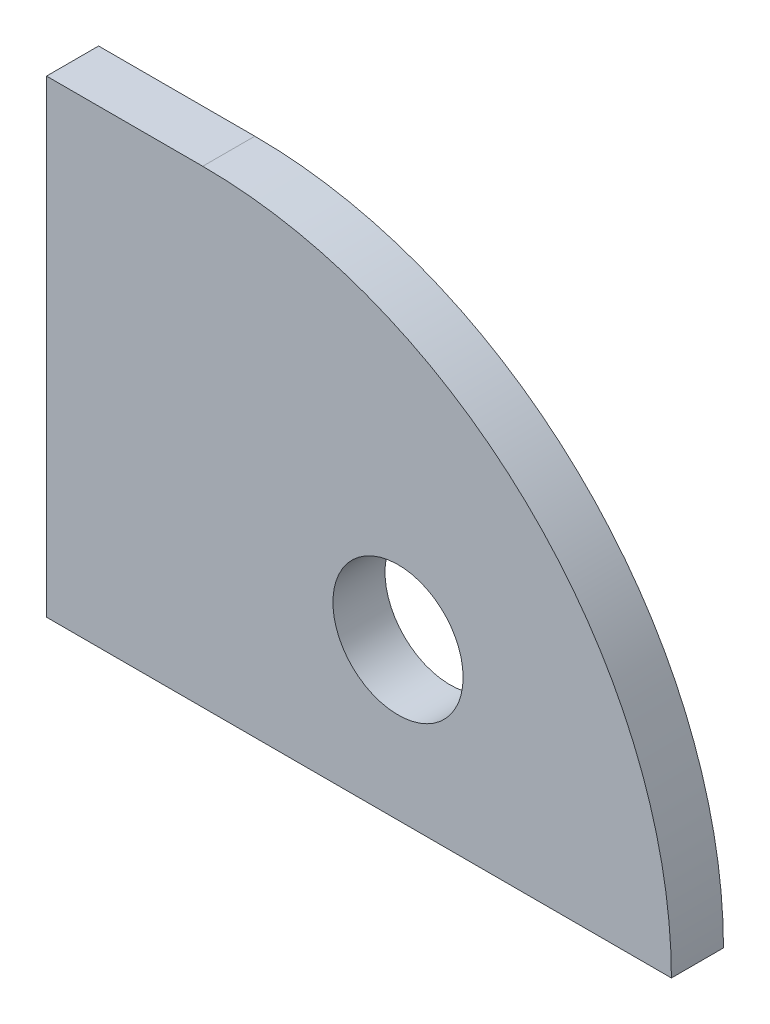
ISO-10303-21;
HEADER;
FILE_DESCRIPTION(('STEP AP214'),'2;1');
FILE_NAME('part.step','',(''),(''),'','','');
FILE_SCHEMA(('AUTOMOTIVE_DESIGN { 1 0 10303 214 1 1 1 1 }'));
ENDSEC;
DATA;
#1=APPLICATION_CONTEXT('core data for automotive mechanical design processes');
#2=APPLICATION_PROTOCOL_DEFINITION('international standard','automotive_design',2000,#1);
#3=PRODUCT_CONTEXT('',#1,'mechanical');
#4=PRODUCT('Part','Part','',(#3));
#5=PRODUCT_RELATED_PRODUCT_CATEGORY('part','',(#4));
#6=PRODUCT_DEFINITION_FORMATION('','',#4);
#7=PRODUCT_DEFINITION_CONTEXT('part definition',#1,'design');
#8=PRODUCT_DEFINITION('design','',#6,#7);
#9=PRODUCT_DEFINITION_SHAPE('','',#8);
#10=(LENGTH_UNIT() NAMED_UNIT(*) SI_UNIT(.MILLI.,.METRE.));
#11=(NAMED_UNIT(*) PLANE_ANGLE_UNIT() SI_UNIT($,.RADIAN.));
#12=(NAMED_UNIT(*) SI_UNIT($,.STERADIAN.) SOLID_ANGLE_UNIT());
#13=UNCERTAINTY_MEASURE_WITH_UNIT(LENGTH_MEASURE(1.E-05),#10,'distance_accuracy_value','');
#14=(GEOMETRIC_REPRESENTATION_CONTEXT(3) GLOBAL_UNCERTAINTY_ASSIGNED_CONTEXT((#13)) GLOBAL_UNIT_ASSIGNED_CONTEXT((#10,
#11,#12)) REPRESENTATION_CONTEXT('',''));
#15=CARTESIAN_POINT('',(0.,0.,0.));
#16=DIRECTION('',(0.,0.,1.));
#17=DIRECTION('',(1.,0.,0.));
#18=AXIS2_PLACEMENT_3D('',#15,#16,#17);
#19=CARTESIAN_POINT('',(27.,16.8234812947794,2.));
#20=DIRECTION('',(0.,-1.,0.));
#21=DIRECTION('',(0.,0.,-1.));
#22=AXIS2_PLACEMENT_3D('',#19,#20,#21);
#23=PLANE('',#22);
#24=DIRECTION('',(-1.,0.,0.));
#25=VECTOR('',#24,1.);
#26=CARTESIAN_POINT('',(27.,16.8234812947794,0.));
#27=LINE('',#26,#25);
#28=CARTESIAN_POINT('',(33.,16.8234812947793,0.));
#29=VERTEX_POINT('',#28);
#30=CARTESIAN_POINT('',(27.,16.8234812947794,0.));
#31=VERTEX_POINT('',#30);
#32=EDGE_CURVE('E392',#29,#31,#27,.T.);
#33=ORIENTED_EDGE('',*,*,#32,.T.);
#34=DIRECTION('',(0.,0.,-1.));
#35=VECTOR('',#34,1.);
#36=CARTESIAN_POINT('',(27.,16.8234812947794,2.));
#37=LINE('',#36,#35);
#38=CARTESIAN_POINT('',(27.,16.8234812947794,2.));
#39=VERTEX_POINT('',#38);
#40=EDGE_CURVE('E11',#39,#31,#37,.T.);
#41=ORIENTED_EDGE('',*,*,#40,.F.);
#42=DIRECTION('',(-1.,0.,0.));
#43=VECTOR('',#42,1.);
#44=CARTESIAN_POINT('',(27.,16.8234812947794,2.));
#45=LINE('',#44,#43);
#46=CARTESIAN_POINT('',(33.,16.8234812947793,2.));
#47=VERTEX_POINT('',#46);
#48=EDGE_CURVE('E415',#47,#39,#45,.T.);
#49=ORIENTED_EDGE('',*,*,#48,.F.);
#50=DIRECTION('',(0.,0.,-1.));
#51=VECTOR('',#50,1.);
#52=CARTESIAN_POINT('',(33.,16.8234812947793,2.));
#53=LINE('',#52,#51);
#54=EDGE_CURVE('E404',#47,#29,#53,.T.);
#55=ORIENTED_EDGE('',*,*,#54,.T.);
#56=EDGE_LOOP('',(#33,#41,#49,#55));
#57=FACE_BOUND('',#56,.T.);
#58=ADVANCED_FACE('F348',(#57),#23,.F.);
#59=CARTESIAN_POINT('',(27.,16.8234812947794,2.));
#60=DIRECTION('',(1.,0.,0.));
#61=DIRECTION('',(0.,0.,-1.));
#62=AXIS2_PLACEMENT_3D('',#59,#60,#61);
#63=PLANE('',#62);
#64=DIRECTION('',(0.,-1.,0.));
#65=VECTOR('',#64,1.);
#66=CARTESIAN_POINT('',(27.,16.8234812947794,0.));
#67=LINE('',#66,#65);
#68=CARTESIAN_POINT('',(27.,-1.17651870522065,0.));
#69=VERTEX_POINT('',#68);
#70=EDGE_CURVE('E388',#31,#69,#67,.T.);
#71=ORIENTED_EDGE('',*,*,#70,.T.);
#72=DIRECTION('',(0.,0.,-1.));
#73=VECTOR('',#72,1.);
#74=CARTESIAN_POINT('',(27.,-1.17651870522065,2.));
#75=LINE('',#74,#73);
#76=CARTESIAN_POINT('',(27.,-1.17651870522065,2.));
#77=VERTEX_POINT('',#76);
#78=EDGE_CURVE('E355',#77,#69,#75,.T.);
#79=ORIENTED_EDGE('',*,*,#78,.F.);
#80=DIRECTION('',(0.,-1.,0.));
#81=VECTOR('',#80,1.);
#82=CARTESIAN_POINT('',(27.,16.8234812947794,2.));
#83=LINE('',#82,#81);
#84=EDGE_CURVE('E400',#39,#77,#83,.T.);
#85=ORIENTED_EDGE('',*,*,#84,.F.);
#86=ORIENTED_EDGE('',*,*,#40,.T.);
#87=EDGE_LOOP('',(#71,#79,#85,#86));
#88=FACE_BOUND('',#87,.T.);
#89=ADVANCED_FACE('F399',(#88),#63,.F.);
#90=CARTESIAN_POINT('',(27.,-1.17651870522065,2.));
#91=DIRECTION('',(0.,1.,0.));
#92=DIRECTION('',(0.,0.,1.));
#93=AXIS2_PLACEMENT_3D('',#90,#91,#92);
#94=PLANE('',#93);
#95=DIRECTION('',(1.,0.,0.));
#96=VECTOR('',#95,1.);
#97=CARTESIAN_POINT('',(27.,-1.17651870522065,0.));
#98=LINE('',#97,#96);
#99=CARTESIAN_POINT('',(51.,-1.17651870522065,0.));
#100=VERTEX_POINT('',#99);
#101=EDGE_CURVE('E393',#69,#100,#98,.T.);
#102=ORIENTED_EDGE('',*,*,#101,.T.);
#103=DIRECTION('',(0.,0.,-1.));
#104=VECTOR('',#103,1.);
#105=CARTESIAN_POINT('',(51.,-1.17651870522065,2.));
#106=LINE('',#105,#104);
#107=CARTESIAN_POINT('',(51.,-1.17651870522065,2.));
#108=VERTEX_POINT('',#107);
#109=EDGE_CURVE('E421',#108,#100,#106,.T.);
#110=ORIENTED_EDGE('',*,*,#109,.F.);
#111=DIRECTION('',(1.,0.,0.));
#112=VECTOR('',#111,1.);
#113=CARTESIAN_POINT('',(27.,-1.17651870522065,2.));
#114=LINE('',#113,#112);
#115=EDGE_CURVE('E367',#77,#108,#114,.T.);
#116=ORIENTED_EDGE('',*,*,#115,.F.);
#117=ORIENTED_EDGE('',*,*,#78,.T.);
#118=EDGE_LOOP('',(#102,#110,#116,#117));
#119=FACE_BOUND('',#118,.T.);
#120=ADVANCED_FACE('F424',(#119),#94,.F.);
#121=CARTESIAN_POINT('',(33.,-1.17651870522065,2.));
#122=DIRECTION('',(0.,0.,-1.));
#123=DIRECTION('',(-1.,0.,0.));
#124=AXIS2_PLACEMENT_3D('',#121,#122,#123);
#125=CYLINDRICAL_SURFACE('',#124,18.);
#126=CARTESIAN_POINT('',(33.,-1.17651870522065,0.));
#127=DIRECTION('',(0.,0.,1.));
#128=DIRECTION('',(-1.,0.,0.));
#129=AXIS2_PLACEMENT_3D('',#126,#127,#128);
#130=CIRCLE('',#129,18.);
#131=EDGE_CURVE('E413',#100,#29,#130,.T.);
#132=ORIENTED_EDGE('',*,*,#131,.T.);
#133=ORIENTED_EDGE('',*,*,#54,.F.);
#134=CARTESIAN_POINT('',(33.,-1.17651870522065,2.));
#135=DIRECTION('',(0.,0.,1.));
#136=DIRECTION('',(-1.,0.,0.));
#137=AXIS2_PLACEMENT_3D('',#134,#135,#136);
#138=CIRCLE('',#137,18.);
#139=EDGE_CURVE('E362',#108,#47,#138,.T.);
#140=ORIENTED_EDGE('',*,*,#139,.F.);
#141=ORIENTED_EDGE('',*,*,#109,.T.);
#142=EDGE_LOOP('',(#132,#133,#140,#141));
#143=FACE_BOUND('',#142,.T.);
#144=ADVANCED_FACE('F426',(#143),#125,.T.);
#145=CARTESIAN_POINT('',(33.,-1.17651870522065,2.));
#146=DIRECTION('',(0.,0.,-1.));
#147=DIRECTION('',(-1.,0.,0.));
#148=AXIS2_PLACEMENT_3D('',#145,#146,#147);
#149=PLANE('',#148);
#150=CARTESIAN_POINT('',(40.5,4.82348129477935,2.));
#151=DIRECTION('',(0.,0.,1.));
#152=DIRECTION('',(1.,0.,0.));
#153=AXIS2_PLACEMENT_3D('',#150,#151,#152);
#154=CIRCLE('',#153,2.5);
#155=CARTESIAN_POINT('',(43.,4.82348129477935,2.));
#156=VERTEX_POINT('',#155);
#157=EDGE_CURVE('E408',#156,#156,#154,.T.);
#158=ORIENTED_EDGE('',*,*,#157,.F.);
#159=EDGE_LOOP('',(#158));
#160=FACE_BOUND('',#159,.T.);
#161=ORIENTED_EDGE('',*,*,#48,.T.);
#162=ORIENTED_EDGE('',*,*,#84,.T.);
#163=ORIENTED_EDGE('',*,*,#115,.T.);
#164=ORIENTED_EDGE('',*,*,#139,.T.);
#165=EDGE_LOOP('',(#161,#162,#163,#164));
#166=FACE_BOUND('',#165,.T.);
#167=ADVANCED_FACE('F427',(#160,#166),#149,.F.);
#168=CARTESIAN_POINT('',(33.,-1.17651870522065,0.));
#169=DIRECTION('',(0.,0.,-1.));
#170=DIRECTION('',(-1.,0.,0.));
#171=AXIS2_PLACEMENT_3D('',#168,#169,#170);
#172=PLANE('',#171);
#173=CARTESIAN_POINT('',(40.5,4.82348129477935,0.));
#174=DIRECTION('',(0.,0.,1.));
#175=DIRECTION('',(1.,0.,0.));
#176=AXIS2_PLACEMENT_3D('',#173,#174,#175);
#177=CIRCLE('',#176,2.5);
#178=CARTESIAN_POINT('',(43.,4.82348129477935,0.));
#179=VERTEX_POINT('',#178);
#180=EDGE_CURVE('E405',#179,#179,#177,.T.);
#181=ORIENTED_EDGE('',*,*,#180,.T.);
#182=EDGE_LOOP('',(#181));
#183=FACE_BOUND('',#182,.T.);
#184=ORIENTED_EDGE('',*,*,#32,.F.);
#185=ORIENTED_EDGE('',*,*,#131,.F.);
#186=ORIENTED_EDGE('',*,*,#101,.F.);
#187=ORIENTED_EDGE('',*,*,#70,.F.);
#188=EDGE_LOOP('',(#184,#185,#186,#187));
#189=FACE_BOUND('',#188,.T.);
#190=ADVANCED_FACE('F389',(#183,#189),#172,.T.);
#191=CARTESIAN_POINT('',(40.5,4.82348129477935,0.));
#192=DIRECTION('',(0.,0.,1.));
#193=DIRECTION('',(1.,0.,0.));
#194=AXIS2_PLACEMENT_3D('',#191,#192,#193);
#195=CYLINDRICAL_SURFACE('',#194,2.5);
#196=ORIENTED_EDGE('',*,*,#180,.F.);
#197=EDGE_LOOP('',(#196));
#198=FACE_BOUND('',#197,.T.);
#199=ORIENTED_EDGE('',*,*,#157,.T.);
#200=EDGE_LOOP('',(#199));
#201=FACE_BOUND('',#200,.T.);
#202=ADVANCED_FACE('F435',(#198,#201),#195,.F.);
#203=CLOSED_SHELL('',(#58,#89,#120,#144,#167,#190,#202));
#204=MANIFOLD_SOLID_BREP('B2',#203);
#205=ADVANCED_BREP_SHAPE_REPRESENTATION('',(#18,#204),#14);
#206=SHAPE_DEFINITION_REPRESENTATION(#9,#205);
ENDSEC;
END-ISO-10303-21;
